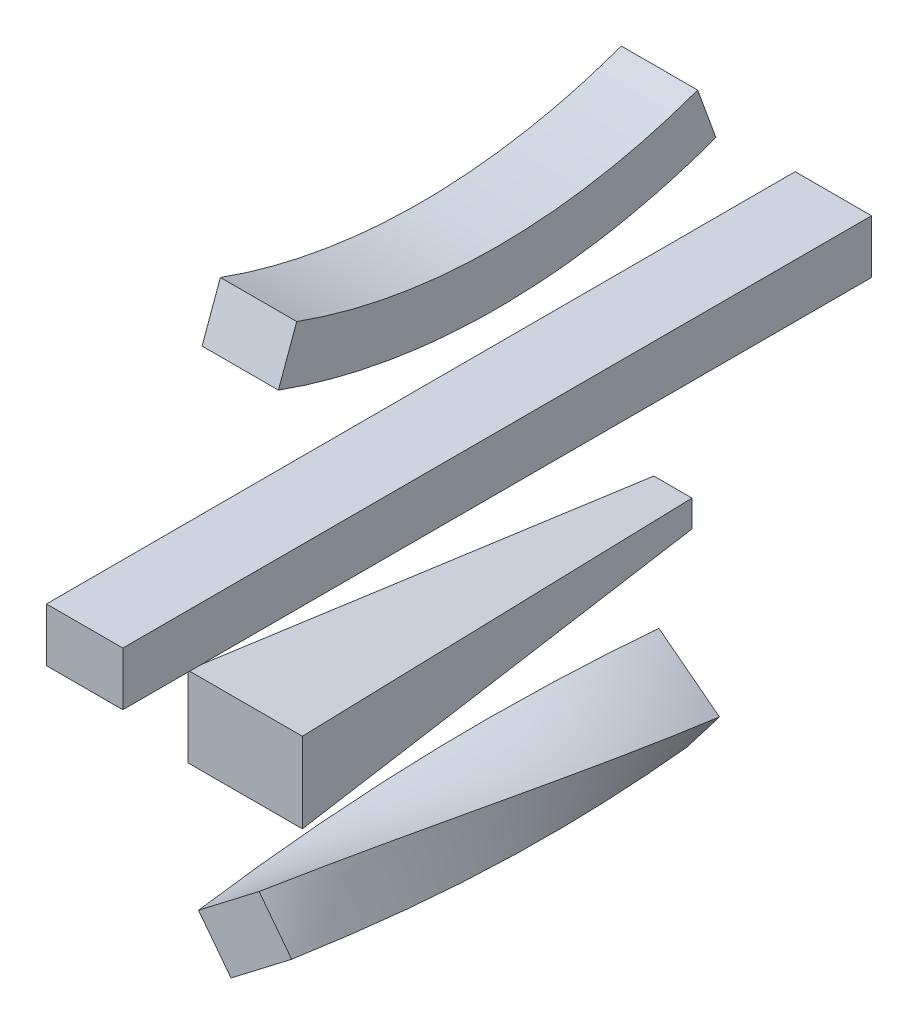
ISO-10303-21;
HEADER;
FILE_DESCRIPTION(('STEP AP214'),'2;1');
FILE_NAME('part.step','',(''),(''),'','','');
FILE_SCHEMA(('AUTOMOTIVE_DESIGN { 1 0 10303 214 1 1 1 1 }'));
ENDSEC;
DATA;
#1=APPLICATION_CONTEXT('core data for automotive mechanical design processes');
#2=APPLICATION_PROTOCOL_DEFINITION('international standard','automotive_design',2000,#1);
#3=PRODUCT_CONTEXT('',#1,'mechanical');
#4=PRODUCT('Part','Part','',(#3));
#5=PRODUCT_RELATED_PRODUCT_CATEGORY('part','',(#4));
#6=PRODUCT_DEFINITION_FORMATION('','',#4);
#7=PRODUCT_DEFINITION_CONTEXT('part definition',#1,'design');
#8=PRODUCT_DEFINITION('design','',#6,#7);
#9=PRODUCT_DEFINITION_SHAPE('','',#8);
#10=(LENGTH_UNIT() NAMED_UNIT(*) SI_UNIT(.MILLI.,.METRE.));
#11=(NAMED_UNIT(*) PLANE_ANGLE_UNIT() SI_UNIT($,.RADIAN.));
#12=(NAMED_UNIT(*) SI_UNIT($,.STERADIAN.) SOLID_ANGLE_UNIT());
#13=UNCERTAINTY_MEASURE_WITH_UNIT(LENGTH_MEASURE(1.E-05),#10,'distance_accuracy_value','');
#14=(GEOMETRIC_REPRESENTATION_CONTEXT(3) GLOBAL_UNCERTAINTY_ASSIGNED_CONTEXT((#13)) GLOBAL_UNIT_ASSIGNED_CONTEXT((#10,
#11,#12)) REPRESENTATION_CONTEXT('',''));
#15=CARTESIAN_POINT('',(0.,0.,0.));
#16=DIRECTION('',(0.,0.,1.));
#17=DIRECTION('',(1.,0.,0.));
#18=AXIS2_PLACEMENT_3D('',#15,#16,#17);
#19=CARTESIAN_POINT('',(5.73929572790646,-82.5258348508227,50.8));
#20=CARTESIAN_POINT('',(3.1622056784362,-79.1673057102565,50.8));
#21=CARTESIAN_POINT('',(0.585115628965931,-75.8087765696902,50.8));
#22=CARTESIAN_POINT('',(-1.99197442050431,-72.450247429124,50.8));
#23=CARTESIAN_POINT('',(4.48297111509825,-82.1298342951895,41.5636572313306));
#24=CARTESIAN_POINT('',(2.30554482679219,-78.4646350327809,41.5636471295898));
#25=CARTESIAN_POINT('',(0.128121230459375,-74.7994351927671,41.5636471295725));
#26=CARTESIAN_POINT('',(-2.04930362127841,-71.1342378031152,41.5636572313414));
#27=CARTESIAN_POINT('',(1.91698663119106,-80.7797782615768,21.5515169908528));
#28=CARTESIAN_POINT('',(0.725404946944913,-76.6069610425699,21.5515200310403));
#29=CARTESIAN_POINT('',(-0.466177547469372,-72.4341439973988,21.5515200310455));
#30=CARTESIAN_POINT('',(-1.65775966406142,-68.2613262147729,21.5515169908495));
#31=CARTESIAN_POINT('',(-1.26317221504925,-77.0065458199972,-12.3151576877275));
#32=CARTESIAN_POINT('',(-0.5751075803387,-72.6653246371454,-12.3151571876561));
#33=CARTESIAN_POINT('',(0.112957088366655,-68.3241031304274,-12.3151571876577));
#34=CARTESIAN_POINT('',(0.801021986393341,-63.9828818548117,-12.3151576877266));
#35=CARTESIAN_POINT('',(-2.07799404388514,-73.4605951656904,-36.9454886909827));
#36=CARTESIAN_POINT('',(-0.100395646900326,-69.6420558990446,-36.9454735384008));
#37=CARTESIAN_POINT('',(1.87720086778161,-65.8235129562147,-36.9454735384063));
#38=CARTESIAN_POINT('',(3.85480142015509,-62.0049708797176,-36.9454886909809));
#39=CARTESIAN_POINT('',(-1.9919744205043,-71.4865822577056,-50.8));
#40=CARTESIAN_POINT('',(0.585115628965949,-68.1280531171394,-50.8));
#41=CARTESIAN_POINT('',(3.16220567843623,-64.7695239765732,-50.8));
#42=CARTESIAN_POINT('',(5.73929572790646,-61.4109948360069,-50.8));
#43=B_SPLINE_SURFACE_WITH_KNOTS('',3,3,((#19,#20,#21,#22),(#23,#24,#25,#26),(#27,#28,#29,#30),
(#31,#32,#33,#34),(#35,#36,#37,#38),(#39,#40,#41,#42)),.UNSPECIFIED.,.F.,.F.,.F.,(4,1,1,4),(4,
4),(0.,0.272727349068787,0.590909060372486,1.),(0.,1.),.UNSPECIFIED.);
#44=DIRECTION('',(-0.608761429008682,-0.793353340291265,-1.6227177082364E-13));
#45=VECTOR('',#44,1.);
#46=CARTESIAN_POINT('',(1.87366065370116,-66.4487885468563,-50.8000000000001));
#47=LINE('',#46,#45);
#48=CARTESIAN_POINT('',(5.73929572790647,-61.4109948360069,-50.8));
#49=VERTEX_POINT('',#48);
#50=CARTESIAN_POINT('',(-1.9919744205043,-71.4865822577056,-50.8));
#51=VERTEX_POINT('',#50);
#52=EDGE_CURVE('E14',#49,#51,#47,.T.);
#53=CARTESIAN_POINT('',(5.73929572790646,-82.5258348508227,50.8));
#54=CARTESIAN_POINT('',(3.8548014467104,-81.931858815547,36.9454888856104));
#55=CARTESIAN_POINT('',(0.801021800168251,-79.9539476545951,12.3151568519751));
#56=CARTESIAN_POINT('',(-1.6577595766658,-75.6755036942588,-21.551515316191));
#57=CARTESIAN_POINT('',(-2.04930361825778,-72.8025918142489,-41.5636577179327));
#58=CARTESIAN_POINT('',(-1.9919744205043,-71.4865822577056,-50.8));
#59=B_SPLINE_CURVE_WITH_KNOTS('',3,(#53,#54,#55,#56,#57,#58),.UNSPECIFIED.,.F.,.F.,(4,1,1,4),
(0.,0.409090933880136,0.72727266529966,1.),.UNSPECIFIED.);
#60=CARTESIAN_POINT('',(5.73929572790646,-82.5258348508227,50.8));
#61=VERTEX_POINT('',#60);
#62=EDGE_CURVE('E509',#61,#51,#59,.T.);
#63=DIRECTION('',(0.608761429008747,-0.793353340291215,0.));
#64=VECTOR('',#63,1.);
#65=CARTESIAN_POINT('',(1.87366065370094,-77.4880411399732,50.7999999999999));
#66=LINE('',#65,#64);
#67=CARTESIAN_POINT('',(-1.99197442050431,-72.450247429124,50.8));
#68=VERTEX_POINT('',#67);
#69=EDGE_CURVE('E557',#68,#61,#66,.T.);
#70=CARTESIAN_POINT('',(-1.99197442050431,-72.450247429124,50.8));
#71=CARTESIAN_POINT('',(-2.04930362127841,-71.1342378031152,41.5636572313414));
#72=CARTESIAN_POINT('',(-1.65775966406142,-68.2613262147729,21.5515169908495));
#73=CARTESIAN_POINT('',(0.801021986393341,-63.9828818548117,-12.3151576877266));
#74=CARTESIAN_POINT('',(3.85480142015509,-62.0049708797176,-36.9454886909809));
#75=CARTESIAN_POINT('',(5.73929572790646,-61.4109948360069,-50.8));
#76=B_SPLINE_CURVE_WITH_KNOTS('',3,(#70,#71,#72,#73,#74,#75),.UNSPECIFIED.,.F.,.F.,(4,1,1,4),
(0.,0.272727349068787,0.590909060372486,1.),.UNSPECIFIED.);
#77=EDGE_CURVE('E501',#68,#49,#76,.T.);
#78=ORIENTED_EDGE('',*,*,#52,.T.);
#79=ORIENTED_EDGE('',*,*,#62,.F.);
#80=ORIENTED_EDGE('',*,*,#69,.F.);
#81=ORIENTED_EDGE('',*,*,#77,.T.);
#82=EDGE_LOOP('',(#78,#79,#80,#81));
#83=FACE_BOUND('',#82,.T.);
#84=ADVANCED_FACE('F489',(#83),#43,.F.);
#85=CARTESIAN_POINT('',(-1.9919744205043,-71.4865822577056,-50.8));
#86=CARTESIAN_POINT('',(2.80357027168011,-75.166333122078,-50.7999999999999));
#87=CARTESIAN_POINT('',(7.59911496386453,-78.8460839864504,-50.8));
#88=CARTESIAN_POINT('',(12.3946596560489,-82.5258348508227,-50.8));
#89=CARTESIAN_POINT('',(-2.04930361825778,-72.8025918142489,-41.5636577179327));
#90=CARTESIAN_POINT('',(3.18412552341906,-75.9116755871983,-41.5636371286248));
#91=CARTESIAN_POINT('',(8.41755773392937,-79.0207525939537,-41.5636371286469));
#92=CARTESIAN_POINT('',(13.6509842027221,-82.1298343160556,-41.5636577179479));
#93=CARTESIAN_POINT('',(-1.6577595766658,-75.6755036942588,-21.551515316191));
#94=CARTESIAN_POINT('',(4.30048329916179,-77.3769276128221,-21.5515215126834));
#95=CARTESIAN_POINT('',(10.2587252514,-79.0783535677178,-21.5515215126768));
#96=CARTESIAN_POINT('',(16.2169689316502,-80.7797781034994,-21.5515153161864));
#97=CARTESIAN_POINT('',(0.801021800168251,-79.9539476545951,12.3151568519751));
#98=CARTESIAN_POINT('',(6.9997232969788,-78.9714805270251,12.3151553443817));
#99=CARTESIAN_POINT('',(13.198425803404,-77.9890136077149,12.3151553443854));
#100=CARTESIAN_POINT('',(19.3971274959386,-77.0065460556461,12.3151568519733));
#101=CARTESIAN_POINT('',(3.8548014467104,-81.931858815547,36.9454888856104));
#102=CARTESIAN_POINT('',(9.30717989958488,-79.1081029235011,36.9454580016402));
#103=CARTESIAN_POINT('',(14.7595669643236,-76.2843541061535,36.9454580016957));
#104=CARTESIAN_POINT('',(20.2119494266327,-73.460595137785,36.9454888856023));
#105=CARTESIAN_POINT('',(5.73929572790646,-82.5258348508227,50.8));
#106=CARTESIAN_POINT('',(10.5348404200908,-78.8460839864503,50.7999999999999));
#107=CARTESIAN_POINT('',(15.3303851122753,-75.166333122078,50.8));
#108=CARTESIAN_POINT('',(20.1259298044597,-71.4865822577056,50.8));
#109=B_SPLINE_SURFACE_WITH_KNOTS('',3,3,((#85,#86,#87,#88),(#89,#90,#91,#92),(#93,#94,#95,#96),
(#97,#98,#99,#100),(#101,#102,#103,#104),(#105,#106,#107,#108)),.UNSPECIFIED.,.F.,.F.,.F.,(4,1,
1,4),(4,4),(0.,0.27272733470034,0.590909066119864,1.),(0.,1.),.UNSPECIFIED.);
#110=DIRECTION('',(0.793353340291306,-0.608761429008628,0.));
#111=VECTOR('',#110,1.);
#112=CARTESIAN_POINT('',(5.20134261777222,-77.0062085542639,-50.8));
#113=LINE('',#112,#111);
#114=CARTESIAN_POINT('',(12.3946596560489,-82.5258348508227,-50.8));
#115=VERTEX_POINT('',#114);
#116=EDGE_CURVE('E548',#51,#115,#113,.T.);
#117=CARTESIAN_POINT('',(20.1259298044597,-71.4865822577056,50.8));
#118=CARTESIAN_POINT('',(20.2119494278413,-73.4605951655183,36.9454886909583));
#119=CARTESIAN_POINT('',(19.3971275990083,-77.0065458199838,12.3151576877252));
#120=CARTESIAN_POINT('',(16.2169687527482,-80.779778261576,-21.5515169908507));
#121=CARTESIAN_POINT('',(13.6509842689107,-82.1298342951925,-41.5636572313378));
#122=CARTESIAN_POINT('',(12.3946596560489,-82.5258348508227,-50.8));
#123=B_SPLINE_CURVE_WITH_KNOTS('',3,(#117,#118,#119,#120,#121,#122),.UNSPECIFIED.,.F.,.F.,(4,1,
1,4),(0.,0.409090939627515,0.727272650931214,1.),.UNSPECIFIED.);
#124=CARTESIAN_POINT('',(20.1259298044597,-71.4865822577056,50.8));
#125=VERTEX_POINT('',#124);
#126=EDGE_CURVE('E534',#125,#115,#123,.T.);
#127=DIRECTION('',(0.793353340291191,0.608761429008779,0.));
#128=VECTOR('',#127,1.);
#129=CARTESIAN_POINT('',(12.9326127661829,-77.0062085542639,50.7999999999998));
#130=LINE('',#129,#128);
#131=EDGE_CURVE('E516',#61,#125,#130,.T.);
#132=ORIENTED_EDGE('',*,*,#116,.T.);
#133=ORIENTED_EDGE('',*,*,#126,.F.);
#134=ORIENTED_EDGE('',*,*,#131,.F.);
#135=ORIENTED_EDGE('',*,*,#62,.T.);
#136=EDGE_LOOP('',(#132,#133,#134,#135));
#137=FACE_BOUND('',#136,.T.);
#138=ADVANCED_FACE('F547',(#137),#109,.F.);
#139=CARTESIAN_POINT('',(12.3946596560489,-82.5258348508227,-50.8));
#140=CARTESIAN_POINT('',(14.9717497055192,-79.1673057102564,-50.8));
#141=CARTESIAN_POINT('',(17.5488397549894,-75.8087765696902,-50.8));
#142=CARTESIAN_POINT('',(20.1259298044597,-72.450247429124,-50.8));
#143=CARTESIAN_POINT('',(13.6509842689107,-82.1298342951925,-41.5636572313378));
#144=CARTESIAN_POINT('',(15.8284105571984,-78.4646350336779,-41.563647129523));
#145=CARTESIAN_POINT('',(18.0058341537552,-74.7994351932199,-41.563647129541));
#146=CARTESIAN_POINT('',(20.1832590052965,-71.1342378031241,-41.5636572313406));
#147=CARTESIAN_POINT('',(16.2169687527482,-80.779778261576,-21.5515169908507));
#148=CARTESIAN_POINT('',(17.4085504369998,-76.6069610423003,-21.5515200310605));
#149=CARTESIAN_POINT('',(18.6001329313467,-72.4341439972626,-21.551520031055));
#150=CARTESIAN_POINT('',(19.791715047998,-68.2613262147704,-21.5515169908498));
#151=CARTESIAN_POINT('',(19.3971275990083,-77.0065458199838,12.3151576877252));
#152=CARTESIAN_POINT('',(18.709062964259,-72.665324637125,12.3151571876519));
#153=CARTESIAN_POINT('',(18.0209982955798,-68.3241031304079,12.3151571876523));
#154=CARTESIAN_POINT('',(17.33293339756,-63.9828818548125,12.315157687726));
#155=CARTESIAN_POINT('',(20.2119494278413,-73.4605951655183,36.9454886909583));
#156=CARTESIAN_POINT('',(18.234351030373,-69.6420558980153,36.9454735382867));
#157=CARTESIAN_POINT('',(16.2567545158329,-65.8235129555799,36.9454735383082));
#158=CARTESIAN_POINT('',(14.27915396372,-62.0049708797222,36.9454886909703));
#159=CARTESIAN_POINT('',(20.1259298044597,-71.4865822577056,50.8));
#160=CARTESIAN_POINT('',(17.5488397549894,-68.1280531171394,50.8));
#161=CARTESIAN_POINT('',(14.9717497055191,-64.7695239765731,50.8));
#162=CARTESIAN_POINT('',(12.3946596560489,-61.410994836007,50.8));
#163=B_SPLINE_SURFACE_WITH_KNOTS('',3,3,((#139,#140,#141,#142),(#143,#144,#145,#146),(#147,#148,
#149,#150),(#151,#152,#153,#154),(#155,#156,#157,#158),(#159,#160,#161,#162)),.UNSPECIFIED.,.F.,
.F.,.F.,(4,1,1,4),(4,4),(0.,0.272727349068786,0.590909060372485,1.),(0.,1.),.UNSPECIFIED.);
#164=DIRECTION('',(0.608761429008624,0.793353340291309,0.));
#165=VECTOR('',#164,1.);
#166=CARTESIAN_POINT('',(16.2602947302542,-77.4880411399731,-50.7999999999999));
#167=LINE('',#166,#165);
#168=CARTESIAN_POINT('',(20.1259298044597,-72.450247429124,-50.8));
#169=VERTEX_POINT('',#168);
#170=EDGE_CURVE('E550',#115,#169,#167,.T.);
#171=CARTESIAN_POINT('',(12.3946596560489,-61.4109948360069,50.8));
#172=CARTESIAN_POINT('',(13.6509842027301,-61.8069953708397,41.5636577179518));
#173=CARTESIAN_POINT('',(16.2169689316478,-63.1570515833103,21.5515153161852));
#174=CARTESIAN_POINT('',(19.3971274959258,-66.9302836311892,-12.3151568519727));
#175=CARTESIAN_POINT('',(20.2119494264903,-70.4762345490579,-36.9454888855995));
#176=CARTESIAN_POINT('',(20.1259298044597,-72.450247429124,-50.8));
#177=B_SPLINE_CURVE_WITH_KNOTS('',3,(#171,#172,#173,#174,#175,#176),.UNSPECIFIED.,.F.,.F.,(4,1,
1,4),(0.,0.27272733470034,0.590909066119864,1.),.UNSPECIFIED.);
#178=CARTESIAN_POINT('',(12.3946596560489,-61.4109948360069,50.8));
#179=VERTEX_POINT('',#178);
#180=EDGE_CURVE('E541',#179,#169,#177,.T.);
#181=DIRECTION('',(-0.608761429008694,0.793353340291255,0.));
#182=VECTOR('',#181,1.);
#183=CARTESIAN_POINT('',(16.2602947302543,-66.4487885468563,50.8000000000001));
#184=LINE('',#183,#182);
#185=EDGE_CURVE('E539',#125,#179,#184,.T.);
#186=ORIENTED_EDGE('',*,*,#170,.T.);
#187=ORIENTED_EDGE('',*,*,#180,.F.);
#188=ORIENTED_EDGE('',*,*,#185,.F.);
#189=ORIENTED_EDGE('',*,*,#126,.T.);
#190=EDGE_LOOP('',(#186,#187,#188,#189));
#191=FACE_BOUND('',#190,.T.);
#192=ADVANCED_FACE('F540',(#191),#163,.F.);
#193=CARTESIAN_POINT('',(-1.99197442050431,-72.450247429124,50.8));
#194=CARTESIAN_POINT('',(2.80357027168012,-68.7704965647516,50.8));
#195=CARTESIAN_POINT('',(7.59911496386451,-65.0907457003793,50.8));
#196=CARTESIAN_POINT('',(12.3946596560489,-61.4109948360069,50.8));
#197=CARTESIAN_POINT('',(-2.04930361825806,-71.1342378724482,41.5636577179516));
#198=CARTESIAN_POINT('',(3.18412552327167,-68.0251540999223,41.5636371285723));
#199=CARTESIAN_POINT('',(8.41755773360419,-64.9160770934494,41.5636371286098));
#200=CARTESIAN_POINT('',(13.6509842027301,-61.8069953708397,41.5636577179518));
#201=CARTESIAN_POINT('',(-1.65775957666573,-68.2613259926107,21.5515153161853));
#202=CARTESIAN_POINT('',(4.30048329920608,-66.5599020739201,21.5515215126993));
#203=CARTESIAN_POINT('',(10.2587252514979,-64.8584761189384,21.551521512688));
#204=CARTESIAN_POINT('',(16.2169689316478,-63.1570515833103,21.5515153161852));
#205=CARTESIAN_POINT('',(0.8010218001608,-63.9828820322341,-12.3151568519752));
#206=CARTESIAN_POINT('',(6.99972329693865,-64.9653491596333,-12.3151553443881));
#207=CARTESIAN_POINT('',(13.1984258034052,-65.9478160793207,-12.3151553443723));
#208=CARTESIAN_POINT('',(19.3971274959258,-66.9302836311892,-12.3151568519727));
#209=CARTESIAN_POINT('',(3.85480144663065,-62.0049708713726,-36.9454888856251));
#210=CARTESIAN_POINT('',(9.30717989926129,-64.8287267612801,-36.9454580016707));
#211=CARTESIAN_POINT('',(14.7595669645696,-67.6524755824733,-36.9454580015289));
#212=CARTESIAN_POINT('',(20.2119494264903,-70.4762345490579,-36.9454888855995));
#213=CARTESIAN_POINT('',(5.73929572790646,-61.4109948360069,-50.8));
#214=CARTESIAN_POINT('',(10.5348404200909,-65.0907457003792,-50.8));
#215=CARTESIAN_POINT('',(15.3303851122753,-68.7704965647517,-50.8));
#216=CARTESIAN_POINT('',(20.1259298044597,-72.450247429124,-50.8));
#217=B_SPLINE_SURFACE_WITH_KNOTS('',3,3,((#193,#194,#195,#196),(#197,#198,#199,#200),(#201,#202,
#203,#204),(#205,#206,#207,#208),(#209,#210,#211,#212),(#213,#214,#215,#216)),.UNSPECIFIED.,.F.,
.F.,.F.,(4,1,1,4),(4,4),(0.,0.27272733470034,0.590909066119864,1.),(0.,1.),.UNSPECIFIED.);
#218=DIRECTION('',(-0.793353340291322,0.608761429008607,0.));
#219=VECTOR('',#218,1.);
#220=CARTESIAN_POINT('',(12.9326127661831,-66.930621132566,-50.8000000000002));
#221=LINE('',#220,#219);
#222=EDGE_CURVE('E551',#169,#49,#221,.T.);
#223=DIRECTION('',(-0.793353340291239,-0.608761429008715,0.));
#224=VECTOR('',#223,1.);
#225=CARTESIAN_POINT('',(5.20134261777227,-66.9306211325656,50.8000000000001));
#226=LINE('',#225,#224);
#227=EDGE_CURVE('E544',#179,#68,#226,.T.);
#228=ORIENTED_EDGE('',*,*,#222,.T.);
#229=ORIENTED_EDGE('',*,*,#77,.F.);
#230=ORIENTED_EDGE('',*,*,#227,.F.);
#231=ORIENTED_EDGE('',*,*,#180,.T.);
#232=EDGE_LOOP('',(#228,#229,#230,#231));
#233=FACE_BOUND('',#232,.T.);
#234=ADVANCED_FACE('F586',(#233),#217,.F.);
#235=CARTESIAN_POINT('',(20.1259298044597,-71.4865822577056,50.8));
#236=DIRECTION('',(0.,0.,-1.));
#237=DIRECTION('',(-0.793353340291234,-0.608761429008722,0.));
#238=AXIS2_PLACEMENT_3D('',#235,#236,#237);
#239=PLANE('',#238);
#240=ORIENTED_EDGE('',*,*,#69,.T.);
#241=ORIENTED_EDGE('',*,*,#131,.T.);
#242=ORIENTED_EDGE('',*,*,#185,.T.);
#243=ORIENTED_EDGE('',*,*,#227,.T.);
#244=EDGE_LOOP('',(#240,#241,#242,#243));
#245=FACE_BOUND('',#244,.T.);
#246=ADVANCED_FACE('F555',(#245),#239,.F.);
#247=CARTESIAN_POINT('',(12.3946596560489,-82.5258348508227,-50.8));
#248=DIRECTION('',(0.,0.,-1.));
#249=DIRECTION('',(-0.793353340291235,0.608761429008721,0.));
#250=AXIS2_PLACEMENT_3D('',#247,#248,#249);
#251=PLANE('',#250);
#252=ORIENTED_EDGE('',*,*,#52,.F.);
#253=ORIENTED_EDGE('',*,*,#222,.F.);
#254=ORIENTED_EDGE('',*,*,#170,.F.);
#255=ORIENTED_EDGE('',*,*,#116,.F.);
#256=EDGE_LOOP('',(#252,#253,#254,#255));
#257=FACE_BOUND('',#256,.T.);
#258=ADVANCED_FACE('F491',(#257),#251,.T.);
#259=CLOSED_SHELL('',(#84,#138,#192,#234,#246,#258));
#260=MANIFOLD_SOLID_BREP('B2',#259);
#261=CARTESIAN_POINT('',(-4.53348884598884,-43.3934148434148,50.8));
#262=DIRECTION('',(0.996041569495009,0.,0.0888886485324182));
#263=DIRECTION('',(0.088716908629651,0.0621323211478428,-0.994117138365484));
#264=AXIS2_PLACEMENT_3D('',#261,#262,#263);
#265=PLANE('',#264);
#266=DIRECTION('',(0.,-1.,-1.18015833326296E-13));
#267=VECTOR('',#266,1.);
#268=CARTESIAN_POINT('',(4.53348884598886,-33.8684148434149,-50.8000000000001));
#269=LINE('',#268,#267);
#270=CARTESIAN_POINT('',(4.53348884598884,-30.6934148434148,-50.8));
#271=VERTEX_POINT('',#270);
#272=CARTESIAN_POINT('',(4.53348884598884,-37.0434148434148,-50.8));
#273=VERTEX_POINT('',#272);
#274=EDGE_CURVE('E487',#271,#273,#269,.T.);
#275=ORIENTED_EDGE('',*,*,#274,.T.);
#276=DIRECTION('',(0.088716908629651,0.0621323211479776,-0.994117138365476));
#277=VECTOR('',#276,1.);
#278=CARTESIAN_POINT('',(1.60353501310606E-13,-40.2184148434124,-2.0122792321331E-12));
#279=LINE('',#278,#277);
#280=CARTESIAN_POINT('',(-4.53348884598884,-43.3934148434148,50.8));
#281=VERTEX_POINT('',#280);
#282=EDGE_CURVE('E778',#281,#273,#279,.T.);
#283=ORIENTED_EDGE('',*,*,#282,.F.);
#284=DIRECTION('',(0.,-1.,0.));
#285=VECTOR('',#284,1.);
#286=CARTESIAN_POINT('',(-4.53348884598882,-33.8684148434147,50.7999999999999));
#287=LINE('',#286,#285);
#288=CARTESIAN_POINT('',(-4.53348884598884,-24.3434148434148,50.8));
#289=VERTEX_POINT('',#288);
#290=EDGE_CURVE('E820',#289,#281,#287,.T.);
#291=ORIENTED_EDGE('',*,*,#290,.F.);
#292=DIRECTION('',(0.0887169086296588,-0.0621323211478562,-0.994117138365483));
#293=VECTOR('',#292,1.);
#294=CARTESIAN_POINT('',(0.,-27.5184148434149,-3.7470027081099E-13));
#295=LINE('',#294,#293);
#296=EDGE_CURVE('E770',#289,#271,#295,.T.);
#297=ORIENTED_EDGE('',*,*,#296,.T.);
#298=EDGE_LOOP('',(#275,#283,#291,#297));
#299=FACE_BOUND('',#298,.T.);
#300=ADVANCED_FACE('F760',(#299),#265,.F.);
#301=CARTESIAN_POINT('',(4.53348884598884,-37.0434148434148,-50.8));
#302=DIRECTION('',(0.,0.998052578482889,0.0623782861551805));
#303=DIRECTION('',(-0.088716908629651,-0.0621323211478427,0.994117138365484));
#304=AXIS2_PLACEMENT_3D('',#301,#302,#303);
#305=PLANE('',#304);
#306=DIRECTION('',(1.,0.,0.));
#307=VECTOR('',#306,1.);
#308=CARTESIAN_POINT('',(9.0669776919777,-37.0434148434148,-50.8000000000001));
#309=LINE('',#308,#307);
#310=CARTESIAN_POINT('',(13.6004665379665,-37.0434148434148,-50.8));
#311=VERTEX_POINT('',#310);
#312=EDGE_CURVE('E812',#273,#311,#309,.T.);
#313=ORIENTED_EDGE('',*,*,#312,.T.);
#314=DIRECTION('',(-0.0887169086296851,0.0621323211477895,-0.994117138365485));
#315=VECTOR('',#314,1.);
#316=CARTESIAN_POINT('',(18.1339553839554,-40.2184148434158,4.83987849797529E-13));
#317=LINE('',#316,#315);
#318=CARTESIAN_POINT('',(22.6674442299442,-43.3934148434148,50.8));
#319=VERTEX_POINT('',#318);
#320=EDGE_CURVE('E802',#319,#311,#317,.T.);
#321=ORIENTED_EDGE('',*,*,#320,.F.);
#322=DIRECTION('',(1.,0.,0.));
#323=VECTOR('',#322,1.);
#324=CARTESIAN_POINT('',(9.0669776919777,-43.3934148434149,50.8000000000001));
#325=LINE('',#324,#323);
#326=EDGE_CURVE('E784',#281,#319,#325,.T.);
#327=ORIENTED_EDGE('',*,*,#326,.F.);
#328=ORIENTED_EDGE('',*,*,#282,.T.);
#329=EDGE_LOOP('',(#313,#321,#327,#328));
#330=FACE_BOUND('',#329,.T.);
#331=ADVANCED_FACE('F811',(#330),#305,.F.);
#332=CARTESIAN_POINT('',(13.6004665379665,-37.0434148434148,-50.8));
#333=DIRECTION('',(-0.996041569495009,0.,0.0888886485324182));
#334=DIRECTION('',(0.088716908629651,-0.0621323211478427,0.994117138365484));
#335=AXIS2_PLACEMENT_3D('',#332,#333,#334);
#336=PLANE('',#335);
#337=DIRECTION('',(0.,1.,-1.18015833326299E-13));
#338=VECTOR('',#337,1.);
#339=CARTESIAN_POINT('',(13.6004665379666,-33.8684148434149,-50.8000000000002));
#340=LINE('',#339,#338);
#341=CARTESIAN_POINT('',(13.6004665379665,-30.6934148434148,-50.8));
#342=VERTEX_POINT('',#341);
#343=EDGE_CURVE('E814',#311,#342,#340,.T.);
#344=ORIENTED_EDGE('',*,*,#343,.T.);
#345=DIRECTION('',(-0.0887169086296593,-0.0621323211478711,-0.994117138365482));
#346=VECTOR('',#345,1.);
#347=CARTESIAN_POINT('',(18.1339553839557,-27.5184148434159,7.75421393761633E-13));
#348=LINE('',#347,#346);
#349=CARTESIAN_POINT('',(22.6674442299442,-24.3434148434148,50.8));
#350=VERTEX_POINT('',#349);
#351=EDGE_CURVE('E808',#350,#342,#348,.T.);
#352=ORIENTED_EDGE('',*,*,#351,.F.);
#353=DIRECTION('',(0.,1.,0.));
#354=VECTOR('',#353,1.);
#355=CARTESIAN_POINT('',(22.6674442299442,-33.8684148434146,50.7999999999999));
#356=LINE('',#355,#354);
#357=EDGE_CURVE('E806',#319,#350,#356,.T.);
#358=ORIENTED_EDGE('',*,*,#357,.F.);
#359=ORIENTED_EDGE('',*,*,#320,.T.);
#360=EDGE_LOOP('',(#344,#352,#358,#359));
#361=FACE_BOUND('',#360,.T.);
#362=ADVANCED_FACE('F807',(#361),#336,.F.);
#363=CARTESIAN_POINT('',(-4.53348884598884,-24.3434148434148,50.8));
#364=DIRECTION('',(0.,-0.998052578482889,0.0623782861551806));
#365=DIRECTION('',(0.088716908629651,-0.0621323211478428,-0.994117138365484));
#366=AXIS2_PLACEMENT_3D('',#363,#364,#365);
#367=PLANE('',#366);
#368=DIRECTION('',(-1.,0.,-1.19385696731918E-13));
#369=VECTOR('',#368,1.);
#370=CARTESIAN_POINT('',(9.06697769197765,-30.6934148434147,-50.8));
#371=LINE('',#370,#369);
#372=EDGE_CURVE('E815',#342,#271,#371,.T.);
#373=ORIENTED_EDGE('',*,*,#372,.T.);
#374=ORIENTED_EDGE('',*,*,#296,.F.);
#375=DIRECTION('',(-1.,0.,0.));
#376=VECTOR('',#375,1.);
#377=CARTESIAN_POINT('',(9.06697769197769,-24.3434148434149,50.8000000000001));
#378=LINE('',#377,#376);
#379=EDGE_CURVE('E764',#350,#289,#378,.T.);
#380=ORIENTED_EDGE('',*,*,#379,.F.);
#381=ORIENTED_EDGE('',*,*,#351,.T.);
#382=EDGE_LOOP('',(#373,#374,#380,#381));
#383=FACE_BOUND('',#382,.T.);
#384=ADVANCED_FACE('F846',(#383),#367,.F.);
#385=CARTESIAN_POINT('',(22.6674442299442,-43.3934148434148,50.8));
#386=DIRECTION('',(0.,0.,-1.));
#387=DIRECTION('',(-1.,0.,0.));
#388=AXIS2_PLACEMENT_3D('',#385,#386,#387);
#389=PLANE('',#388);
#390=ORIENTED_EDGE('',*,*,#290,.T.);
#391=ORIENTED_EDGE('',*,*,#326,.T.);
#392=ORIENTED_EDGE('',*,*,#357,.T.);
#393=ORIENTED_EDGE('',*,*,#379,.T.);
#394=EDGE_LOOP('',(#390,#391,#392,#393));
#395=FACE_BOUND('',#394,.T.);
#396=ADVANCED_FACE('F818',(#395),#389,.F.);
#397=CARTESIAN_POINT('',(13.6004665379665,-37.0434148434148,-50.8));
#398=DIRECTION('',(0.,0.,-1.));
#399=DIRECTION('',(-1.,0.,0.));
#400=AXIS2_PLACEMENT_3D('',#397,#398,#399);
#401=PLANE('',#400);
#402=ORIENTED_EDGE('',*,*,#274,.F.);
#403=ORIENTED_EDGE('',*,*,#372,.F.);
#404=ORIENTED_EDGE('',*,*,#343,.F.);
#405=ORIENTED_EDGE('',*,*,#312,.F.);
#406=EDGE_LOOP('',(#402,#403,#404,#405));
#407=FACE_BOUND('',#406,.T.);
#408=ADVANCED_FACE('F762',(#407),#401,.T.);
#409=CLOSED_SHELL('',(#300,#331,#362,#384,#396,#408));
#410=MANIFOLD_SOLID_BREP('B8',#409);
#411=CARTESIAN_POINT('',(0.,-2.11841484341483,50.8));
#412=DIRECTION('',(1.,0.,0.));
#413=DIRECTION('',(0.,0.,-1.));
#414=AXIS2_PLACEMENT_3D('',#411,#412,#413);
#415=PLANE('',#414);
#416=DIRECTION('',(0.,-1.,-1.54076226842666E-13));
#417=VECTOR('',#416,1.);
#418=CARTESIAN_POINT('',(0.,4.23158515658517,-88.9000000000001));
#419=LINE('',#418,#417);
#420=CARTESIAN_POINT('',(0.,10.5815851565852,-88.9));
#421=VERTEX_POINT('',#420);
#422=CARTESIAN_POINT('',(0.,-2.11841484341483,-88.9));
#423=VERTEX_POINT('',#422);
#424=EDGE_CURVE('E758',#421,#423,#419,.T.);
#425=ORIENTED_EDGE('',*,*,#424,.T.);
#426=DIRECTION('',(0.,0.,-1.));
#427=VECTOR('',#426,1.);
#428=CARTESIAN_POINT('',(0.,-2.1184148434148,1.97758476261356E-12));
#429=LINE('',#428,#427);
#430=CARTESIAN_POINT('',(0.,-2.11841484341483,88.9));
#431=VERTEX_POINT('',#430);
#432=EDGE_CURVE('E928',#431,#423,#429,.T.);
#433=ORIENTED_EDGE('',*,*,#432,.F.);
#434=DIRECTION('',(0.,-1.,2.36031666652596E-13));
#435=VECTOR('',#434,1.);
#436=CARTESIAN_POINT('',(0.,4.23158515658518,88.9000000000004));
#437=LINE('',#436,#435);
#438=CARTESIAN_POINT('',(0.,10.5815851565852,88.9));
#439=VERTEX_POINT('',#438);
#440=EDGE_CURVE('E970',#439,#431,#437,.T.);
#441=ORIENTED_EDGE('',*,*,#440,.F.);
#442=DIRECTION('',(0.,0.,-1.));
#443=VECTOR('',#442,1.);
#444=CARTESIAN_POINT('',(0.,10.581585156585,2.09554595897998E-12));
#445=LINE('',#444,#443);
#446=EDGE_CURVE('E920',#439,#421,#445,.T.);
#447=ORIENTED_EDGE('',*,*,#446,.T.);
#448=EDGE_LOOP('',(#425,#433,#441,#447));
#449=FACE_BOUND('',#448,.T.);
#450=ADVANCED_FACE('F910',(#449),#415,.F.);
#451=CARTESIAN_POINT('',(0.,-2.11841484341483,50.8));
#452=DIRECTION('',(0.,1.,0.));
#453=DIRECTION('',(0.,0.,1.));
#454=AXIS2_PLACEMENT_3D('',#451,#452,#453);
#455=PLANE('',#454);
#456=DIRECTION('',(1.,0.,0.));
#457=VECTOR('',#456,1.);
#458=CARTESIAN_POINT('',(9.06697769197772,-2.11841484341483,-88.9000000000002));
#459=LINE('',#458,#457);
#460=CARTESIAN_POINT('',(18.1339553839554,-2.11841484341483,-88.9));
#461=VERTEX_POINT('',#460);
#462=EDGE_CURVE('E962',#423,#461,#459,.T.);
#463=ORIENTED_EDGE('',*,*,#462,.T.);
#464=DIRECTION('',(0.,0.,-1.));
#465=VECTOR('',#464,1.);
#466=CARTESIAN_POINT('',(18.133955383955,-2.11841484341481,1.99319727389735E-12));
#467=LINE('',#466,#465);
#468=CARTESIAN_POINT('',(18.1339553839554,-2.11841484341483,88.9));
#469=VERTEX_POINT('',#468);
#470=EDGE_CURVE('E952',#469,#461,#467,.T.);
#471=ORIENTED_EDGE('',*,*,#470,.F.);
#472=DIRECTION('',(1.,0.,0.));
#473=VECTOR('',#472,1.);
#474=CARTESIAN_POINT('',(9.06697769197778,-2.11841484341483,88.9000000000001));
#475=LINE('',#474,#473);
#476=EDGE_CURVE('E934',#431,#469,#475,.T.);
#477=ORIENTED_EDGE('',*,*,#476,.F.);
#478=ORIENTED_EDGE('',*,*,#432,.T.);
#479=EDGE_LOOP('',(#463,#471,#477,#478));
#480=FACE_BOUND('',#479,.T.);
#481=ADVANCED_FACE('F961',(#480),#455,.F.);
#482=CARTESIAN_POINT('',(18.1339553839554,-2.11841484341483,50.8));
#483=DIRECTION('',(-1.,0.,0.));
#484=DIRECTION('',(0.,0.,1.));
#485=AXIS2_PLACEMENT_3D('',#482,#483,#484);
#486=PLANE('',#485);
#487=DIRECTION('',(0.,1.,-1.60632662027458E-13));
#488=VECTOR('',#487,1.);
#489=CARTESIAN_POINT('',(18.1339553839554,4.23158515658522,-88.9000000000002));
#490=LINE('',#489,#488);
#491=CARTESIAN_POINT('',(18.1339553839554,10.5815851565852,-88.9));
#492=VERTEX_POINT('',#491);
#493=EDGE_CURVE('E964',#461,#492,#490,.T.);
#494=ORIENTED_EDGE('',*,*,#493,.T.);
#495=DIRECTION('',(0.,0.,-1.));
#496=VECTOR('',#495,1.);
#497=CARTESIAN_POINT('',(18.133955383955,10.581585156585,2.04003480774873E-12));
#498=LINE('',#497,#496);
#499=CARTESIAN_POINT('',(18.1339553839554,10.5815851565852,88.9));
#500=VERTEX_POINT('',#499);
#501=EDGE_CURVE('E958',#500,#492,#498,.T.);
#502=ORIENTED_EDGE('',*,*,#501,.F.);
#503=DIRECTION('',(0.,1.,1.18015833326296E-13));
#504=VECTOR('',#503,1.);
#505=CARTESIAN_POINT('',(18.1339553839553,4.23158515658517,88.9000000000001));
#506=LINE('',#505,#504);
#507=EDGE_CURVE('E956',#469,#500,#506,.T.);
#508=ORIENTED_EDGE('',*,*,#507,.F.);
#509=ORIENTED_EDGE('',*,*,#470,.T.);
#510=EDGE_LOOP('',(#494,#502,#508,#509));
#511=FACE_BOUND('',#510,.T.);
#512=ADVANCED_FACE('F957',(#511),#486,.F.);
#513=CARTESIAN_POINT('',(0.,10.5815851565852,50.8));
#514=DIRECTION('',(0.,-1.,0.));
#515=DIRECTION('',(0.,0.,-1.));
#516=AXIS2_PLACEMENT_3D('',#513,#514,#515);
#517=PLANE('',#516);
#518=DIRECTION('',(-1.,0.,0.));
#519=VECTOR('',#518,1.);
#520=CARTESIAN_POINT('',(9.06697769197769,10.5815851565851,-88.9000000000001));
#521=LINE('',#520,#519);
#522=EDGE_CURVE('E965',#492,#421,#521,.T.);
#523=ORIENTED_EDGE('',*,*,#522,.T.);
#524=ORIENTED_EDGE('',*,*,#446,.F.);
#525=DIRECTION('',(-1.,0.,0.));
#526=VECTOR('',#525,1.);
#527=CARTESIAN_POINT('',(9.06697769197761,10.5815851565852,88.9000000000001));
#528=LINE('',#527,#526);
#529=EDGE_CURVE('E914',#500,#439,#528,.T.);
#530=ORIENTED_EDGE('',*,*,#529,.F.);
#531=ORIENTED_EDGE('',*,*,#501,.T.);
#532=EDGE_LOOP('',(#523,#524,#530,#531));
#533=FACE_BOUND('',#532,.T.);
#534=ADVANCED_FACE('F996',(#533),#517,.F.);
#535=CARTESIAN_POINT('',(18.1339553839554,-2.11841484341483,88.9));
#536=DIRECTION('',(0.,0.,-1.));
#537=DIRECTION('',(-1.,0.,0.));
#538=AXIS2_PLACEMENT_3D('',#535,#536,#537);
#539=PLANE('',#538);
#540=ORIENTED_EDGE('',*,*,#440,.T.);
#541=ORIENTED_EDGE('',*,*,#476,.T.);
#542=ORIENTED_EDGE('',*,*,#507,.T.);
#543=ORIENTED_EDGE('',*,*,#529,.T.);
#544=EDGE_LOOP('',(#540,#541,#542,#543));
#545=FACE_BOUND('',#544,.T.);
#546=ADVANCED_FACE('F968',(#545),#539,.F.);
#547=CARTESIAN_POINT('',(18.1339553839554,-2.11841484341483,-88.9));
#548=DIRECTION('',(0.,0.,-1.));
#549=DIRECTION('',(-1.,0.,0.));
#550=AXIS2_PLACEMENT_3D('',#547,#548,#549);
#551=PLANE('',#550);
#552=ORIENTED_EDGE('',*,*,#424,.F.);
#553=ORIENTED_EDGE('',*,*,#522,.F.);
#554=ORIENTED_EDGE('',*,*,#493,.F.);
#555=ORIENTED_EDGE('',*,*,#462,.F.);
#556=EDGE_LOOP('',(#552,#553,#554,#555));
#557=FACE_BOUND('',#556,.T.);
#558=ADVANCED_FACE('F912',(#557),#551,.T.);
#559=CLOSED_SHELL('',(#450,#481,#512,#534,#546,#558));
#560=MANIFOLD_SOLID_BREP('B481',#559);
#561=CARTESIAN_POINT('',(0.,-14.8184148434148,0.));
#562=DIRECTION('',(1.,0.,0.));
#563=DIRECTION('',(0.,0.,-1.));
#564=AXIS2_PLACEMENT_3D('',#561,#562,#563);
#565=PLANE('',#564);
#566=DIRECTION('',(0.,-0.939692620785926,-0.342020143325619));
#567=VECTOR('',#566,1.);
#568=CARTESIAN_POINT('',(0.,51.1081952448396,-49.7746292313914));
#569=LINE('',#568,#567);
#570=CARTESIAN_POINT('',(0.,57.0752433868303,-47.6028013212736));
#571=VERTEX_POINT('',#570);
#572=CARTESIAN_POINT('',(0.,45.1411471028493,-51.9464571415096));
#573=VERTEX_POINT('',#572);
#574=EDGE_CURVE('E908',#571,#573,#569,.T.);
#575=ORIENTED_EDGE('',*,*,#574,.T.);
#576=CARTESIAN_POINT('',(0.,187.862865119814,0.));
#577=DIRECTION('',(1.,0.,0.));
#578=DIRECTION('',(0.,-0.939692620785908,0.342020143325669));
#579=AXIS2_PLACEMENT_3D('',#576,#577,#578);
#580=CIRCLE('',#579,151.881279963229);
#581=CARTESIAN_POINT('',(0.,45.1411471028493,51.9464571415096));
#582=VERTEX_POINT('',#581);
#583=EDGE_CURVE('E1071',#582,#573,#580,.T.);
#584=ORIENTED_EDGE('',*,*,#583,.F.);
#585=DIRECTION('',(0.,-0.939692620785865,0.342020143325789));
#586=VECTOR('',#585,1.);
#587=CARTESIAN_POINT('',(0.,51.1081952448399,49.7746292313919));
#588=LINE('',#587,#586);
#589=CARTESIAN_POINT('',(0.,57.0752433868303,47.6028013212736));
#590=VERTEX_POINT('',#589);
#591=EDGE_CURVE('E1119',#590,#582,#588,.T.);
#592=ORIENTED_EDGE('',*,*,#591,.F.);
#593=CARTESIAN_POINT('',(0.,57.0752433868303,47.6028013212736));
#594=CARTESIAN_POINT('',(0.,54.9969793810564,41.8927477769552));
#595=CARTESIAN_POINT('',(0.,53.4241403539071,36.0227485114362));
#596=CARTESIAN_POINT('',(0.,51.8512679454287,30.1526246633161));
#597=CARTESIAN_POINT('',(0.,50.796085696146,24.1685711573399));
#598=CARTESIAN_POINT('',(0.,49.7409831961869,18.1849699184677));
#599=CARTESIAN_POINT('',(0.,49.2112343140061,12.1304457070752));
#600=CARTESIAN_POINT('',(0.,48.6816093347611,6.07733758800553));
#601=CARTESIAN_POINT('',(0.,48.6815988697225,2.81165091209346E-07));
#602=CARTESIAN_POINT('',(0.,48.6815884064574,-6.07630705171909));
#603=CARTESIAN_POINT('',(0.,49.2112271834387,-12.1304462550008));
#604=CARTESIAN_POINT('',(0.,49.7407589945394,-18.1833627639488));
#605=CARTESIAN_POINT('',(0.,50.7960747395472,-24.1685734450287));
#606=CARTESIAN_POINT('',(0.,51.851155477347,-30.1524512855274));
#607=CARTESIAN_POINT('',(0.,53.4240785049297,-36.022764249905));
#608=CARTESIAN_POINT('',(0.,54.9967287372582,-41.8920591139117));
#609=CARTESIAN_POINT('',(0.,57.0752433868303,-47.6028013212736));
#610=B_SPLINE_CURVE_WITH_KNOTS('',2,(#593,#594,#595,#596,#597,#598,#599,#600,#601,#602,#603,
#604,#605,#606,#607,#608,#609),.UNSPECIFIED.,.F.,.F.,(3,2,2,2,2,2,2,2,3),(0.,0.125,0.25,0.375,
0.5,0.625,0.75,0.875,1.),.UNSPECIFIED.);
#611=EDGE_CURVE('E1063',#590,#571,#610,.T.);
#612=ORIENTED_EDGE('',*,*,#611,.T.);
#613=EDGE_LOOP('',(#575,#584,#592,#612));
#614=FACE_BOUND('',#613,.T.);
#615=ADVANCED_FACE('F1051',(#614),#565,.F.);
#616=CARTESIAN_POINT('',(0.,187.862865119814,0.));
#617=DIRECTION('',(1.,0.,0.));
#618=DIRECTION('',(0.,0.,1.));
#619=AXIS2_PLACEMENT_3D('',#616,#617,#618);
#620=CYLINDRICAL_SURFACE('',#619,151.881279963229);
#621=DIRECTION('',(1.,0.,0.));
#622=VECTOR('',#621,1.);
#623=CARTESIAN_POINT('',(9.06697769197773,45.1411471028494,-51.9464571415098));
#624=LINE('',#623,#622);
#625=CARTESIAN_POINT('',(18.1339553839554,45.1411471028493,-51.9464571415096));
#626=VERTEX_POINT('',#625);
#627=EDGE_CURVE('E1110',#573,#626,#624,.T.);
#628=ORIENTED_EDGE('',*,*,#627,.T.);
#629=CARTESIAN_POINT('',(18.1339553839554,45.1411471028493,51.9464571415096));
#630=CARTESIAN_POINT('',(18.1339553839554,42.873181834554,45.715203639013));
#631=CARTESIAN_POINT('',(18.1339553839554,41.1568311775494,39.3097631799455));
#632=CARTESIAN_POINT('',(18.1339553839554,39.4405668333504,32.9046448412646));
#633=CARTESIAN_POINT('',(18.1339553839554,38.2890136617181,26.3739058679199));
#634=CARTESIAN_POINT('',(18.1339553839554,37.1376793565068,19.8444081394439));
#635=CARTESIAN_POINT('',(18.1339553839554,36.559577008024,13.2373211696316));
#636=CARTESIAN_POINT('',(18.1339553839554,35.9816155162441,6.6318440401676));
#637=CARTESIAN_POINT('',(18.1339553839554,35.9816290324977,1.06502258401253E-06));
#638=CARTESIAN_POINT('',(18.1339553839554,35.9816425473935,-6.63117564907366));
#639=CARTESIAN_POINT('',(18.1339553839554,36.5595582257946,-13.2373246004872));
#640=CARTESIAN_POINT('',(18.1339553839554,37.1373495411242,-19.842051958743));
#641=CARTESIAN_POINT('',(18.1339553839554,38.289076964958,-26.373894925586));
#642=CARTESIAN_POINT('',(18.1339553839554,39.4405353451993,-32.9042120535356));
#643=CARTESIAN_POINT('',(18.1339553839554,41.1568534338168,-39.3097578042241));
#644=CARTESIAN_POINT('',(18.1339553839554,42.8730412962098,-45.7148175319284));
#645=CARTESIAN_POINT('',(18.1339553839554,45.1411471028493,-51.9464571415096));
#646=B_SPLINE_CURVE_WITH_KNOTS('',2,(#629,#630,#631,#632,#633,#634,#635,#636,#637,#638,#639,
#640,#641,#642,#643,#644,#645),.UNSPECIFIED.,.F.,.F.,(3,2,2,2,2,2,2,2,3),(0.,0.125,0.25,0.375,
0.5,0.625,0.75,0.875,1.),.UNSPECIFIED.);
#647=CARTESIAN_POINT('',(18.1339553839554,45.1411471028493,51.9464571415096));
#648=VERTEX_POINT('',#647);
#649=EDGE_CURVE('E1096',#648,#626,#646,.T.);
#650=ORIENTED_EDGE('',*,*,#649,.F.);
#651=DIRECTION('',(1.,0.,0.));
#652=VECTOR('',#651,1.);
#653=CARTESIAN_POINT('',(9.06697769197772,45.1411471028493,51.9464571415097));
#654=LINE('',#653,#652);
#655=EDGE_CURVE('E1078',#582,#648,#654,.T.);
#656=ORIENTED_EDGE('',*,*,#655,.F.);
#657=ORIENTED_EDGE('',*,*,#583,.T.);
#658=EDGE_LOOP('',(#628,#650,#656,#657));
#659=FACE_BOUND('',#658,.T.);
#660=ADVANCED_FACE('F1109',(#659),#620,.T.);
#661=CARTESIAN_POINT('',(18.1339553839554,-14.8184148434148,0.));
#662=DIRECTION('',(1.,0.,0.));
#663=DIRECTION('',(0.,0.,-1.));
#664=AXIS2_PLACEMENT_3D('',#661,#662,#663);
#665=PLANE('',#664);
#666=DIRECTION('',(0.,0.939692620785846,0.342020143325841));
#667=VECTOR('',#666,1.);
#668=CARTESIAN_POINT('',(18.1339553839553,51.1081952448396,-49.7746292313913));
#669=LINE('',#668,#667);
#670=CARTESIAN_POINT('',(18.1339553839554,57.0752433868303,-47.6028013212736));
#671=VERTEX_POINT('',#670);
#672=EDGE_CURVE('E1112',#626,#671,#669,.T.);
#673=ORIENTED_EDGE('',*,*,#672,.T.);
#674=CARTESIAN_POINT('',(18.1339553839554,187.862865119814,0.));
#675=DIRECTION('',(1.,0.,0.));
#676=DIRECTION('',(0.,-0.939692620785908,0.342020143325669));
#677=AXIS2_PLACEMENT_3D('',#674,#675,#676);
#678=CIRCLE('',#677,139.181279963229);
#679=CARTESIAN_POINT('',(18.1339553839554,57.0752433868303,47.6028013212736));
#680=VERTEX_POINT('',#679);
#681=EDGE_CURVE('E1103',#680,#671,#678,.T.);
#682=ORIENTED_EDGE('',*,*,#681,.F.);
#683=DIRECTION('',(0.,0.939692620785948,-0.342020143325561));
#684=VECTOR('',#683,1.);
#685=CARTESIAN_POINT('',(18.1339553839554,51.1081952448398,49.7746292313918));
#686=LINE('',#685,#684);
#687=EDGE_CURVE('E1101',#648,#680,#686,.T.);
#688=ORIENTED_EDGE('',*,*,#687,.F.);
#689=ORIENTED_EDGE('',*,*,#649,.T.);
#690=EDGE_LOOP('',(#673,#682,#688,#689));
#691=FACE_BOUND('',#690,.T.);
#692=ADVANCED_FACE('F1102',(#691),#665,.T.);
#693=CARTESIAN_POINT('',(0.,187.862865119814,0.));
#694=DIRECTION('',(1.,0.,0.));
#695=DIRECTION('',(0.,0.,1.));
#696=AXIS2_PLACEMENT_3D('',#693,#694,#695);
#697=CYLINDRICAL_SURFACE('',#696,139.181279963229);
#698=DIRECTION('',(-1.,0.,0.));
#699=VECTOR('',#698,1.);
#700=CARTESIAN_POINT('',(9.06697769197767,57.0752433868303,-47.6028013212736));
#701=LINE('',#700,#699);
#702=EDGE_CURVE('E1113',#671,#571,#701,.T.);
#703=ORIENTED_EDGE('',*,*,#702,.T.);
#704=ORIENTED_EDGE('',*,*,#611,.F.);
#705=DIRECTION('',(-1.,0.,0.));
#706=VECTOR('',#705,1.);
#707=CARTESIAN_POINT('',(9.06697769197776,57.0752433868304,47.6028013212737));
#708=LINE('',#707,#706);
#709=EDGE_CURVE('E1106',#680,#590,#708,.T.);
#710=ORIENTED_EDGE('',*,*,#709,.F.);
#711=ORIENTED_EDGE('',*,*,#681,.T.);
#712=EDGE_LOOP('',(#703,#704,#710,#711));
#713=FACE_BOUND('',#712,.T.);
#714=ADVANCED_FACE('F1146',(#713),#697,.F.);
#715=CARTESIAN_POINT('',(18.1339553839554,45.1411471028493,51.9464571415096));
#716=DIRECTION('',(0.,-0.34202014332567,-0.939692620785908));
#717=DIRECTION('',(-1.,0.,0.));
#718=AXIS2_PLACEMENT_3D('',#715,#716,#717);
#719=PLANE('',#718);
#720=ORIENTED_EDGE('',*,*,#591,.T.);
#721=ORIENTED_EDGE('',*,*,#655,.T.);
#722=ORIENTED_EDGE('',*,*,#687,.T.);
#723=ORIENTED_EDGE('',*,*,#709,.T.);
#724=EDGE_LOOP('',(#720,#721,#722,#723));
#725=FACE_BOUND('',#724,.T.);
#726=ADVANCED_FACE('F1117',(#725),#719,.F.);
#727=CARTESIAN_POINT('',(18.1339553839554,45.1411471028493,-51.9464571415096));
#728=DIRECTION('',(0.,0.342020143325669,-0.939692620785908));
#729=DIRECTION('',(-1.,0.,0.));
#730=AXIS2_PLACEMENT_3D('',#727,#728,#729);
#731=PLANE('',#730);
#732=ORIENTED_EDGE('',*,*,#574,.F.);
#733=ORIENTED_EDGE('',*,*,#702,.F.);
#734=ORIENTED_EDGE('',*,*,#672,.F.);
#735=ORIENTED_EDGE('',*,*,#627,.F.);
#736=EDGE_LOOP('',(#732,#733,#734,#735));
#737=FACE_BOUND('',#736,.T.);
#738=ADVANCED_FACE('F1053',(#737),#731,.T.);
#739=CLOSED_SHELL('',(#615,#660,#692,#714,#726,#738));
#740=MANIFOLD_SOLID_BREP('B752',#739);
#741=ADVANCED_BREP_SHAPE_REPRESENTATION('',(#18,#260,#410,#560,#740),#14);
#742=SHAPE_DEFINITION_REPRESENTATION(#9,#741);
ENDSEC;
END-ISO-10303-21;
